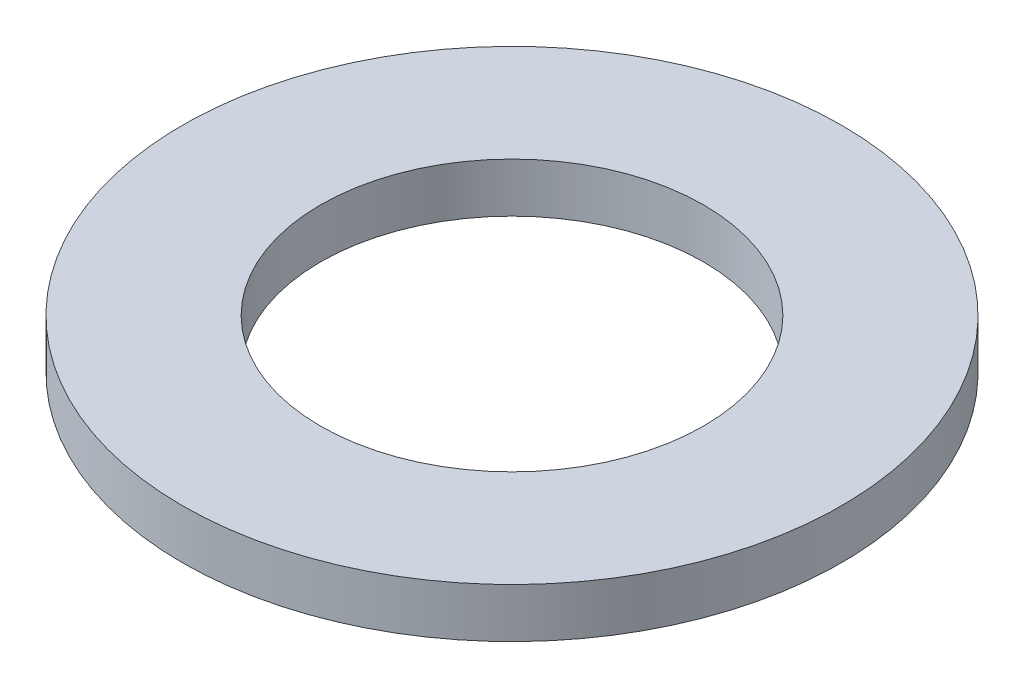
ISO-10303-21;
HEADER;
FILE_DESCRIPTION(('STEP AP214'),'2;1');
FILE_NAME('part.step','',(''),(''),'','','');
FILE_SCHEMA(('AUTOMOTIVE_DESIGN { 1 0 10303 214 1 1 1 1 }'));
ENDSEC;
DATA;
#1=APPLICATION_CONTEXT('core data for automotive mechanical design processes');
#2=APPLICATION_PROTOCOL_DEFINITION('international standard','automotive_design',2000,#1);
#3=PRODUCT_CONTEXT('',#1,'mechanical');
#4=PRODUCT('Part','Part','',(#3));
#5=PRODUCT_RELATED_PRODUCT_CATEGORY('part','',(#4));
#6=PRODUCT_DEFINITION_FORMATION('','',#4);
#7=PRODUCT_DEFINITION_CONTEXT('part definition',#1,'design');
#8=PRODUCT_DEFINITION('design','',#6,#7);
#9=PRODUCT_DEFINITION_SHAPE('','',#8);
#10=(LENGTH_UNIT() NAMED_UNIT(*) SI_UNIT(.MILLI.,.METRE.));
#11=(NAMED_UNIT(*) PLANE_ANGLE_UNIT() SI_UNIT($,.RADIAN.));
#12=(NAMED_UNIT(*) SI_UNIT($,.STERADIAN.) SOLID_ANGLE_UNIT());
#13=UNCERTAINTY_MEASURE_WITH_UNIT(LENGTH_MEASURE(1.E-05),#10,'distance_accuracy_value','');
#14=(GEOMETRIC_REPRESENTATION_CONTEXT(3) GLOBAL_UNCERTAINTY_ASSIGNED_CONTEXT((#13)) GLOBAL_UNIT_ASSIGNED_CONTEXT((#10,
#11,#12)) REPRESENTATION_CONTEXT('',''));
#15=CARTESIAN_POINT('',(0.,0.,0.));
#16=DIRECTION('',(0.,0.,1.));
#17=DIRECTION('',(1.,0.,0.));
#18=AXIS2_PLACEMENT_3D('',#15,#16,#17);
#19=CARTESIAN_POINT('',(0.,12.,0.));
#20=DIRECTION('',(0.,1.,0.));
#21=DIRECTION('',(0.,0.,1.));
#22=AXIS2_PLACEMENT_3D('',#19,#20,#21);
#23=PLANE('',#22);
#24=CARTESIAN_POINT('',(0.,12.,0.));
#25=DIRECTION('',(0.,1.,0.));
#26=DIRECTION('',(0.,0.,1.));
#27=AXIS2_PLACEMENT_3D('',#24,#25,#26);
#28=CIRCLE('',#27,80.);
#29=CARTESIAN_POINT('',(0.,12.,80.));
#30=VERTEX_POINT('',#29);
#31=EDGE_CURVE('E10',#30,#30,#28,.T.);
#32=ORIENTED_EDGE('',*,*,#31,.T.);
#33=EDGE_LOOP('',(#32));
#34=FACE_BOUND('',#33,.T.);
#35=CARTESIAN_POINT('',(0.,12.,0.));
#36=DIRECTION('',(0.,1.,0.));
#37=DIRECTION('',(0.,0.,1.));
#38=AXIS2_PLACEMENT_3D('',#35,#36,#37);
#39=CIRCLE('',#38,46.5);
#40=CARTESIAN_POINT('',(0.,12.,46.5));
#41=VERTEX_POINT('',#40);
#42=EDGE_CURVE('E39',#41,#41,#39,.T.);
#43=ORIENTED_EDGE('',*,*,#42,.F.);
#44=EDGE_LOOP('',(#43));
#45=FACE_BOUND('',#44,.T.);
#46=ADVANCED_FACE('F28',(#34,#45),#23,.T.);
#47=CARTESIAN_POINT('',(0.,0.,0.));
#48=DIRECTION('',(0.,1.,0.));
#49=DIRECTION('',(0.,0.,1.));
#50=AXIS2_PLACEMENT_3D('',#47,#48,#49);
#51=PLANE('',#50);
#52=CARTESIAN_POINT('',(0.,0.,0.));
#53=DIRECTION('',(0.,1.,0.));
#54=DIRECTION('',(0.,0.,1.));
#55=AXIS2_PLACEMENT_3D('',#52,#53,#54);
#56=CIRCLE('',#55,80.);
#57=CARTESIAN_POINT('',(0.,0.,80.));
#58=VERTEX_POINT('',#57);
#59=EDGE_CURVE('E35',#58,#58,#56,.T.);
#60=ORIENTED_EDGE('',*,*,#59,.F.);
#61=EDGE_LOOP('',(#60));
#62=FACE_BOUND('',#61,.T.);
#63=CARTESIAN_POINT('',(0.,0.,0.));
#64=DIRECTION('',(0.,1.,0.));
#65=DIRECTION('',(0.,0.,1.));
#66=AXIS2_PLACEMENT_3D('',#63,#64,#65);
#67=CIRCLE('',#66,46.5);
#68=CARTESIAN_POINT('',(0.,0.,46.5));
#69=VERTEX_POINT('',#68);
#70=EDGE_CURVE('E43',#69,#69,#67,.T.);
#71=ORIENTED_EDGE('',*,*,#70,.T.);
#72=EDGE_LOOP('',(#71));
#73=FACE_BOUND('',#72,.T.);
#74=ADVANCED_FACE('F49',(#62,#73),#51,.F.);
#75=CARTESIAN_POINT('',(0.,12.,0.));
#76=DIRECTION('',(0.,-1.,0.));
#77=DIRECTION('',(0.,0.,-1.));
#78=AXIS2_PLACEMENT_3D('',#75,#76,#77);
#79=CYLINDRICAL_SURFACE('',#78,80.);
#80=ORIENTED_EDGE('',*,*,#31,.F.);
#81=EDGE_LOOP('',(#80));
#82=FACE_BOUND('',#81,.T.);
#83=ORIENTED_EDGE('',*,*,#59,.T.);
#84=EDGE_LOOP('',(#83));
#85=FACE_BOUND('',#84,.T.);
#86=ADVANCED_FACE('F30',(#82,#85),#79,.T.);
#87=CARTESIAN_POINT('',(0.,12.,0.));
#88=DIRECTION('',(0.,-1.,0.));
#89=DIRECTION('',(0.,0.,-1.));
#90=AXIS2_PLACEMENT_3D('',#87,#88,#89);
#91=CYLINDRICAL_SURFACE('',#90,46.5);
#92=ORIENTED_EDGE('',*,*,#42,.T.);
#93=EDGE_LOOP('',(#92));
#94=FACE_BOUND('',#93,.T.);
#95=ORIENTED_EDGE('',*,*,#70,.F.);
#96=EDGE_LOOP('',(#95));
#97=FACE_BOUND('',#96,.T.);
#98=ADVANCED_FACE('F51',(#94,#97),#91,.F.);
#99=CLOSED_SHELL('',(#46,#74,#86,#98));
#100=MANIFOLD_SOLID_BREP('B2',#99);
#101=ADVANCED_BREP_SHAPE_REPRESENTATION('',(#18,#100),#14);
#102=SHAPE_DEFINITION_REPRESENTATION(#9,#101);
ENDSEC;
END-ISO-10303-21;
